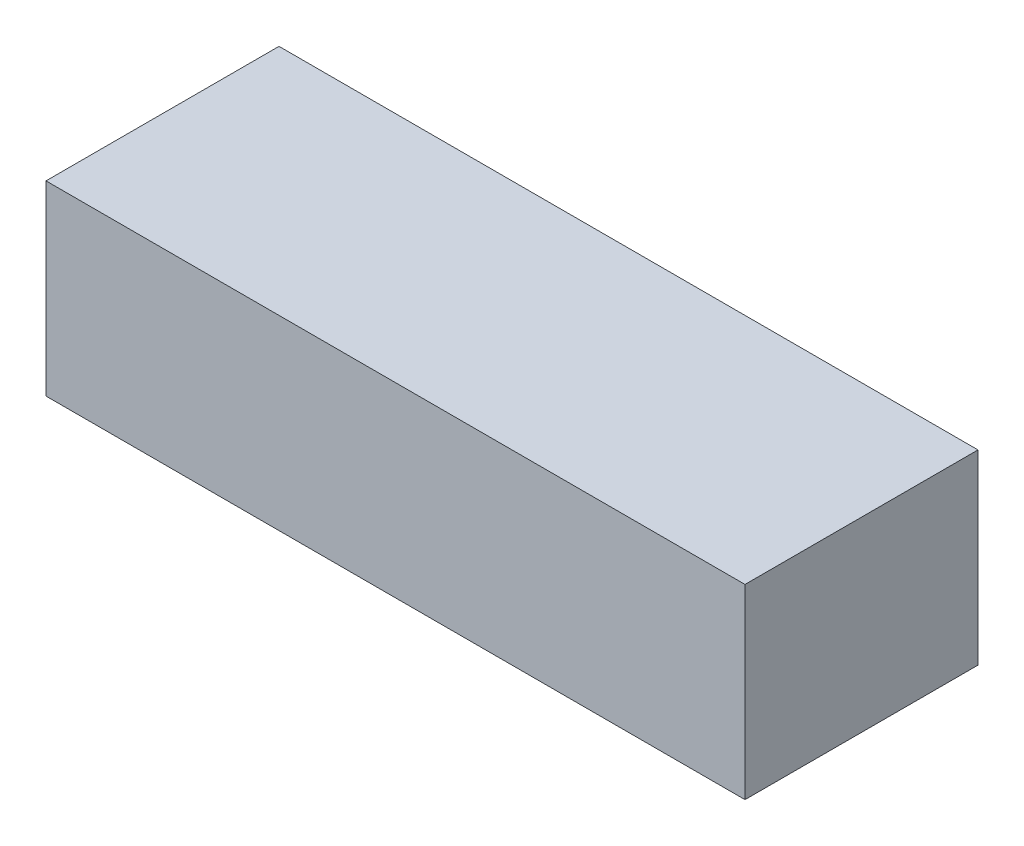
ISO-10303-21;
HEADER;
FILE_DESCRIPTION(('STEP AP214'),'2;1');
FILE_NAME('part.step','',(''),(''),'','','');
FILE_SCHEMA(('AUTOMOTIVE_DESIGN { 1 0 10303 214 1 1 1 1 }'));
ENDSEC;
DATA;
#1=APPLICATION_CONTEXT('core data for automotive mechanical design processes');
#2=APPLICATION_PROTOCOL_DEFINITION('international standard','automotive_design',2000,#1);
#3=PRODUCT_CONTEXT('',#1,'mechanical');
#4=PRODUCT('Part','Part','',(#3));
#5=PRODUCT_RELATED_PRODUCT_CATEGORY('part','',(#4));
#6=PRODUCT_DEFINITION_FORMATION('','',#4);
#7=PRODUCT_DEFINITION_CONTEXT('part definition',#1,'design');
#8=PRODUCT_DEFINITION('design','',#6,#7);
#9=PRODUCT_DEFINITION_SHAPE('','',#8);
#10=(LENGTH_UNIT() NAMED_UNIT(*) SI_UNIT(.MILLI.,.METRE.));
#11=(NAMED_UNIT(*) PLANE_ANGLE_UNIT() SI_UNIT($,.RADIAN.));
#12=(NAMED_UNIT(*) SI_UNIT($,.STERADIAN.) SOLID_ANGLE_UNIT());
#13=UNCERTAINTY_MEASURE_WITH_UNIT(LENGTH_MEASURE(1.E-05),#10,'distance_accuracy_value','');
#14=(GEOMETRIC_REPRESENTATION_CONTEXT(3) GLOBAL_UNCERTAINTY_ASSIGNED_CONTEXT((#13)) GLOBAL_UNIT_ASSIGNED_CONTEXT((#10,
#11,#12)) REPRESENTATION_CONTEXT('',''));
#15=CARTESIAN_POINT('',(0.,0.,0.));
#16=DIRECTION('',(0.,0.,1.));
#17=DIRECTION('',(1.,0.,0.));
#18=AXIS2_PLACEMENT_3D('',#15,#16,#17);
#19=CARTESIAN_POINT('',(-19.05,10.16,6.35));
#20=DIRECTION('',(1.,0.,0.));
#21=DIRECTION('',(0.,0.,-1.));
#22=AXIS2_PLACEMENT_3D('',#19,#20,#21);
#23=PLANE('',#22);
#24=DIRECTION('',(0.,0.,1.));
#25=VECTOR('',#24,1.);
#26=CARTESIAN_POINT('',(-19.05,0.,6.35));
#27=LINE('',#26,#25);
#28=CARTESIAN_POINT('',(-19.05,0.,-6.35));
#29=VERTEX_POINT('',#28);
#30=CARTESIAN_POINT('',(-19.05,0.,6.35));
#31=VERTEX_POINT('',#30);
#32=EDGE_CURVE('E96',#29,#31,#27,.T.);
#33=ORIENTED_EDGE('',*,*,#32,.T.);
#34=DIRECTION('',(0.,-1.,0.));
#35=VECTOR('',#34,1.);
#36=CARTESIAN_POINT('',(-19.05,10.16,6.35));
#37=LINE('',#36,#35);
#38=CARTESIAN_POINT('',(-19.05,10.16,6.35));
#39=VERTEX_POINT('',#38);
#40=EDGE_CURVE('E11',#39,#31,#37,.T.);
#41=ORIENTED_EDGE('',*,*,#40,.F.);
#42=DIRECTION('',(0.,0.,1.));
#43=VECTOR('',#42,1.);
#44=CARTESIAN_POINT('',(-19.05,10.16,6.35));
#45=LINE('',#44,#43);
#46=CARTESIAN_POINT('',(-19.05,10.16,-6.35));
#47=VERTEX_POINT('',#46);
#48=EDGE_CURVE('E84',#47,#39,#45,.T.);
#49=ORIENTED_EDGE('',*,*,#48,.F.);
#50=DIRECTION('',(0.,-1.,0.));
#51=VECTOR('',#50,1.);
#52=CARTESIAN_POINT('',(-19.05,10.16,-6.35));
#53=LINE('',#52,#51);
#54=EDGE_CURVE('E92',#47,#29,#53,.T.);
#55=ORIENTED_EDGE('',*,*,#54,.T.);
#56=EDGE_LOOP('',(#33,#41,#49,#55));
#57=FACE_BOUND('',#56,.T.);
#58=ADVANCED_FACE('F33',(#57),#23,.F.);
#59=CARTESIAN_POINT('',(19.05,10.16,6.35));
#60=DIRECTION('',(0.,0.,-1.));
#61=DIRECTION('',(-1.,0.,0.));
#62=AXIS2_PLACEMENT_3D('',#59,#60,#61);
#63=PLANE('',#62);
#64=DIRECTION('',(1.,0.,0.));
#65=VECTOR('',#64,1.);
#66=CARTESIAN_POINT('',(19.05,0.,6.35));
#67=LINE('',#66,#65);
#68=CARTESIAN_POINT('',(19.05,0.,6.35));
#69=VERTEX_POINT('',#68);
#70=EDGE_CURVE('E88',#31,#69,#67,.T.);
#71=ORIENTED_EDGE('',*,*,#70,.T.);
#72=DIRECTION('',(0.,-1.,0.));
#73=VECTOR('',#72,1.);
#74=CARTESIAN_POINT('',(19.05,10.16,6.35));
#75=LINE('',#74,#73);
#76=CARTESIAN_POINT('',(19.05,10.16,6.35));
#77=VERTEX_POINT('',#76);
#78=EDGE_CURVE('E41',#77,#69,#75,.T.);
#79=ORIENTED_EDGE('',*,*,#78,.F.);
#80=DIRECTION('',(1.,0.,0.));
#81=VECTOR('',#80,1.);
#82=CARTESIAN_POINT('',(19.05,10.16,6.35));
#83=LINE('',#82,#81);
#84=EDGE_CURVE('E79',#39,#77,#83,.T.);
#85=ORIENTED_EDGE('',*,*,#84,.F.);
#86=ORIENTED_EDGE('',*,*,#40,.T.);
#87=EDGE_LOOP('',(#71,#79,#85,#86));
#88=FACE_BOUND('',#87,.T.);
#89=ADVANCED_FACE('F87',(#88),#63,.F.);
#90=CARTESIAN_POINT('',(19.05,10.16,6.35));
#91=DIRECTION('',(-1.,0.,0.));
#92=DIRECTION('',(0.,0.,1.));
#93=AXIS2_PLACEMENT_3D('',#90,#91,#92);
#94=PLANE('',#93);
#95=DIRECTION('',(0.,0.,-1.));
#96=VECTOR('',#95,1.);
#97=CARTESIAN_POINT('',(19.05,0.,6.35));
#98=LINE('',#97,#96);
#99=CARTESIAN_POINT('',(19.05,0.,-6.35));
#100=VERTEX_POINT('',#99);
#101=EDGE_CURVE('E66',#69,#100,#98,.T.);
#102=ORIENTED_EDGE('',*,*,#101,.T.);
#103=DIRECTION('',(0.,-1.,0.));
#104=VECTOR('',#103,1.);
#105=CARTESIAN_POINT('',(19.05,10.16,-6.35));
#106=LINE('',#105,#104);
#107=CARTESIAN_POINT('',(19.05,10.16,-6.35));
#108=VERTEX_POINT('',#107);
#109=EDGE_CURVE('E89',#108,#100,#106,.T.);
#110=ORIENTED_EDGE('',*,*,#109,.F.);
#111=DIRECTION('',(0.,0.,-1.));
#112=VECTOR('',#111,1.);
#113=CARTESIAN_POINT('',(19.05,10.16,6.35));
#114=LINE('',#113,#112);
#115=EDGE_CURVE('E82',#77,#108,#114,.T.);
#116=ORIENTED_EDGE('',*,*,#115,.F.);
#117=ORIENTED_EDGE('',*,*,#78,.T.);
#118=EDGE_LOOP('',(#102,#110,#116,#117));
#119=FACE_BOUND('',#118,.T.);
#120=ADVANCED_FACE('F90',(#119),#94,.F.);
#121=CARTESIAN_POINT('',(19.05,10.16,-6.35));
#122=DIRECTION('',(0.,0.,1.));
#123=DIRECTION('',(1.,0.,0.));
#124=AXIS2_PLACEMENT_3D('',#121,#122,#123);
#125=PLANE('',#124);
#126=DIRECTION('',(-1.,0.,0.));
#127=VECTOR('',#126,1.);
#128=CARTESIAN_POINT('',(19.05,0.,-6.35));
#129=LINE('',#128,#127);
#130=EDGE_CURVE('E72',#100,#29,#129,.T.);
#131=ORIENTED_EDGE('',*,*,#130,.T.);
#132=ORIENTED_EDGE('',*,*,#54,.F.);
#133=DIRECTION('',(-1.,0.,0.));
#134=VECTOR('',#133,1.);
#135=CARTESIAN_POINT('',(19.05,10.16,-6.35));
#136=LINE('',#135,#134);
#137=EDGE_CURVE('E49',#108,#47,#136,.T.);
#138=ORIENTED_EDGE('',*,*,#137,.F.);
#139=ORIENTED_EDGE('',*,*,#109,.T.);
#140=EDGE_LOOP('',(#131,#132,#138,#139));
#141=FACE_BOUND('',#140,.T.);
#142=ADVANCED_FACE('F103',(#141),#125,.F.);
#143=CARTESIAN_POINT('',(0.,10.16,0.));
#144=DIRECTION('',(0.,1.,0.));
#145=DIRECTION('',(0.,0.,1.));
#146=AXIS2_PLACEMENT_3D('',#143,#144,#145);
#147=PLANE('',#146);
#148=ORIENTED_EDGE('',*,*,#48,.T.);
#149=ORIENTED_EDGE('',*,*,#84,.T.);
#150=ORIENTED_EDGE('',*,*,#115,.T.);
#151=ORIENTED_EDGE('',*,*,#137,.T.);
#152=EDGE_LOOP('',(#148,#149,#150,#151));
#153=FACE_BOUND('',#152,.T.);
#154=ADVANCED_FACE('F80',(#153),#147,.T.);
#155=CARTESIAN_POINT('',(0.,0.,0.));
#156=DIRECTION('',(0.,1.,0.));
#157=DIRECTION('',(0.,0.,1.));
#158=AXIS2_PLACEMENT_3D('',#155,#156,#157);
#159=PLANE('',#158);
#160=ORIENTED_EDGE('',*,*,#32,.F.);
#161=ORIENTED_EDGE('',*,*,#130,.F.);
#162=ORIENTED_EDGE('',*,*,#101,.F.);
#163=ORIENTED_EDGE('',*,*,#70,.F.);
#164=EDGE_LOOP('',(#160,#161,#162,#163));
#165=FACE_BOUND('',#164,.T.);
#166=ADVANCED_FACE('F106',(#165),#159,.F.);
#167=CLOSED_SHELL('',(#58,#89,#120,#142,#154,#166));
#168=MANIFOLD_SOLID_BREP('B2',#167);
#169=ADVANCED_BREP_SHAPE_REPRESENTATION('',(#18,#168),#14);
#170=SHAPE_DEFINITION_REPRESENTATION(#9,#169);
ENDSEC;
END-ISO-10303-21;
